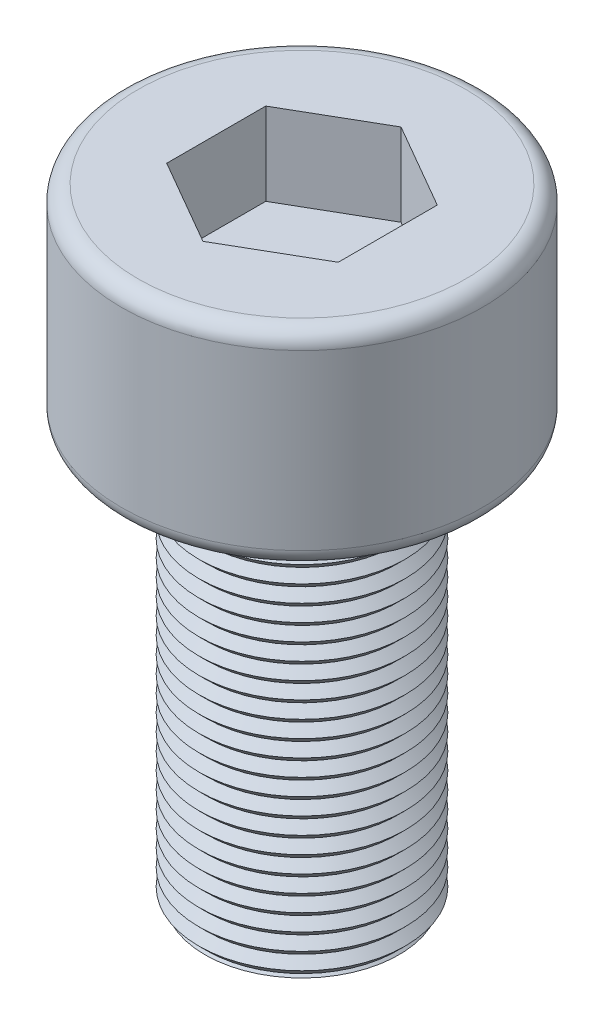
from build123d import *

# Parameters (mm, degrees)
CUT_EXTRUDE1_DEPTH = 1.27
FILLET1_R          = 0.254


with BuildPart() as part:
    # Sketch1 → Revolve1 (revolve)
    with BuildSketch(Plane.XY, mode=Mode.PRIVATE) as revolve1_sk:
        Polygon((-1.458607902, 6.3499873), (-1.587496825, 6.3499873), (-2.778119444, 6.3499873), (-2.778119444, 9.52498095), (0, 9.52498095), (0, 0), (-1.493037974, 0), (-1.458607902, 0.034430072), (-1.587496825, 0.163318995), (-1.458607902, 0.292207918), (-1.587496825, 0.421096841), (-1.458607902, 0.549985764), (-1.587496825, 0.678874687), (-1.458607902, 0.80776361), (-1.587496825, 0.936652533), (-1.458607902, 1.065541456), (-1.587496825, 1.194430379), (-1.458607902, 1.323319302), (-1.587496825, 1.452208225), (-1.458607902, 1.581097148), (-1.587496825, 1.709986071), (-1.458607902, 1.838874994), (-1.587496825, 1.967763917), (-1.458607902, 2.09665284), (-1.587496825, 2.225541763), (-1.458607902, 2.354430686), (-1.587496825, 2.483319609), (-1.458607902, 2.612208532), (-1.587496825, 2.741097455), (-1.458607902, 2.869986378), (-1.587496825, 2.998875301), (-1.458607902, 3.127764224), (-1.587496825, 3.256653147), (-1.458607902, 3.38554207), (-1.587496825, 3.514430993), (-1.458607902, 3.643319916), (-1.587496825, 3.772208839), (-1.458607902, 3.901097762), (-1.587496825, 4.029986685), (-1.458607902, 4.158875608), (-1.587496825, 4.287764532), (-1.458607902, 4.416653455), (-1.587496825, 4.545542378), (-1.458607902, 4.674431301), (-1.587496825, 4.803320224), (-1.458607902, 4.932209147), (-1.587496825, 5.06109807), (-1.458607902, 5.189986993), (-1.587496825, 5.318875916), (-1.458607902, 5.447764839), (-1.587496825, 5.576653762), (-1.458607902, 5.705542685), (-1.587496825, 5.834431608), (-1.458607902, 5.963320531), (-1.587496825, 6.092209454), (-1.458607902, 6.221098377), align=None)
    revolve(revolve1_sk.sketch.rotate(Axis((0, 9.52498095, 0), (0, -1, 0)), 270), axis=Axis((0, 9.52498095, 0), (0, -1, 0)))

    # Sketch2 → Cut-Extrude1 (cut)
    with BuildSketch(Plane(origin=(0, 9.52498095, 0), x_dir=(1, 0, 0), z_dir=(0, 1, 0))):
        Polygon((0, 1.524), (-1.319822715, 0.762), (-1.319822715, -0.762), (0, -1.524), (1.319822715, -0.762), (1.319822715, 0.762), align=None)
    extrude(amount=-CUT_EXTRUDE1_DEPTH, mode=Mode.SUBTRACT)

    # Fillet1
    fillet1_edges = [part.edges().sort_by_distance(p)[0] for p in [
        (0, 6.3499873, -2.778119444),
        (0, 9.52498095, -2.778119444),
    ]]
    fillet(fillet1_edges, radius=FILLET1_R)


solid = part.part
